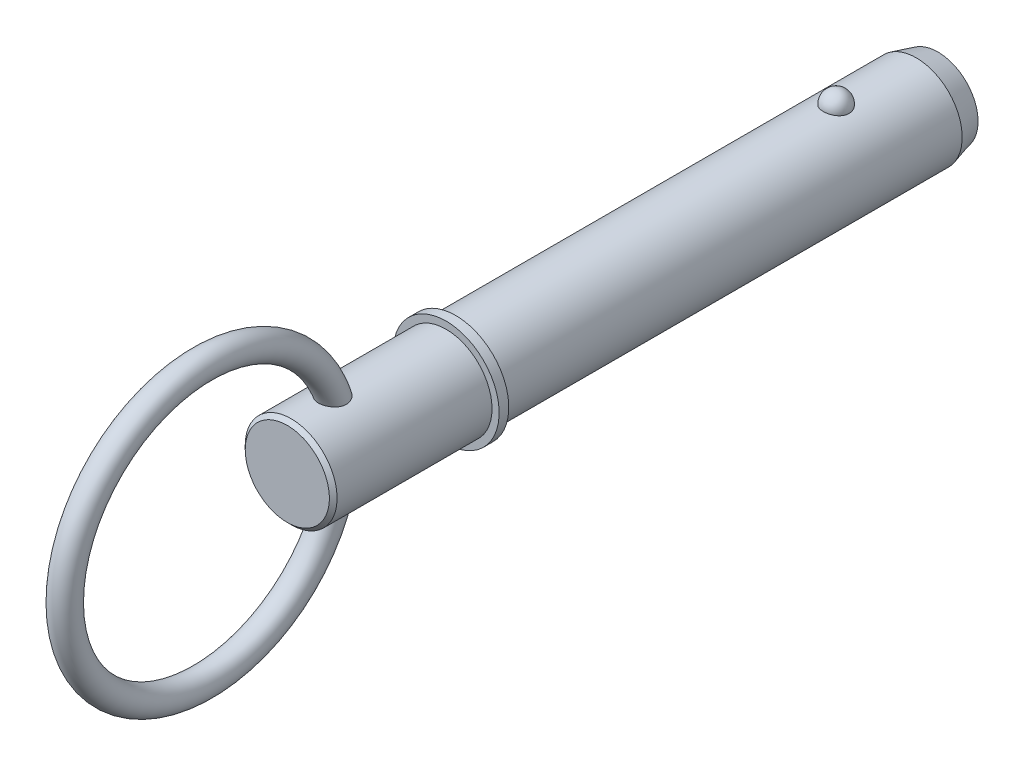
from build123d import *

# Parameters (mm, degrees)
SKETCH2_R           = 9.525
BOSS_EXTRUDE1_DEPTH = 76.2
BOSS_EXTRUDE2_START = 23.8
SKETCH3_R           = 9.525
BOSS_EXTRUDE2_DEPTH = 23.8
CHAMFER1_SIZE       = 4.5
CHAMFER1_SIZE2      = 1.205771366
SKETCH20_W          = 2
SKETCH20_H          = 11
SKETCH21_R          = 9.525
BOSS_EXTRUDE3_DEPTH = 34.93
CHAMFER2_SIZE       = 0.8
SKETCH24_R          = 2.75


with BuildPart() as part:
    # Sketch2 → Boss-Extrude1 (new body)
    with BuildSketch(Plane.XY):
        with Locations(Location((0, 0, 0), (0, 0, 180))):
            Circle(SKETCH2_R)
    extrude(amount=BOSS_EXTRUDE1_DEPTH)

    # Sketch3 → Boss-Extrude2 (add)
    with BuildSketch(Plane(origin=(0, 0, 0), x_dir=(-1, 0, 0), z_dir=(0, 0, -1)).offset(BOSS_EXTRUDE2_START)):
        Circle(SKETCH3_R)
    extrude(amount=-BOSS_EXTRUDE2_DEPTH)

    # Chamfer1
    chamfer1_edges = [part.edges().sort_by_distance(p)[0] for p in [
        (9.525, 0, -23.8),
    ]]
    chamfer1_side = [part.faces().sort_by_distance(p)[0] for p in [
        (9.525, 0, 26.2),
    ]]
    chamfer(chamfer1_edges, length=CHAMFER1_SIZE, length2=CHAMFER1_SIZE2, reference=chamfer1_side[0])

    # Sketch18 → Revolve1 (revolve)
    with BuildSketch(Plane(origin=(0, 0, 0), x_dir=(0, 0, -1), z_dir=(1, 0, 0))):
        with BuildLine():
            Line((2.69, 12.215), (2.69, 6.835))
            ThreePointArc((2.69, 6.835), (0, 9.525), (2.69, 12.215))
        make_face()
    revolve(axis=Axis((0, 12.215, -2.69), (0, -1, 0)))

    # Sketch20 → Revolve2 (revolve)
    with BuildSketch(Plane(origin=(0, 0, 0), x_dir=(0, 0, -1), z_dir=(1, 0, 0)), mode=Mode.PRIVATE) as revolve2_sk:
        with Locations((-77.2, 5.5)):
            Rectangle(SKETCH20_W, SKETCH20_H)
    revolve(revolve2_sk.sketch.rotate(Axis((0, 0, 33.728787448), (0, 0, 1)), 90), axis=Axis((0, 0, 33.728787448), (0, 0, 1)))

    # Sketch21 → Boss-Extrude3 (add)
    with BuildSketch(Plane(origin=(0, 0, 76.2), x_dir=(-1, 0, 0), z_dir=(0, 0, -1))):
        Circle(SKETCH21_R)
    extrude(amount=-BOSS_EXTRUDE3_DEPTH)

    # Chamfer2
    chamfer2_edges = [part.edges().sort_by_distance(p)[0] for p in [
        (9.525, 0, 111.13),
    ]]
    chamfer(chamfer2_edges, length=CHAMFER2_SIZE)

    # Sweep1: sweep along a path in Sketch23
    with BuildLine(Plane(origin=(0, 0, 0), x_dir=(0, 0, -1), z_dir=(1, 0, 0))) as sweep1_path:
        CenterArc((-128.705, 0), 28.575, 0, 360)
    # Sketch24 → Sweep1 (sweep)
    with BuildSketch(Plane(origin=(0, 0, 0), x_dir=(1, 0, 0), z_dir=(0, 1, 0))):
        with Locations((0, -100.13)):
            Circle(SKETCH24_R)
    sweep(path=sweep1_path.line)


solid = part.part
